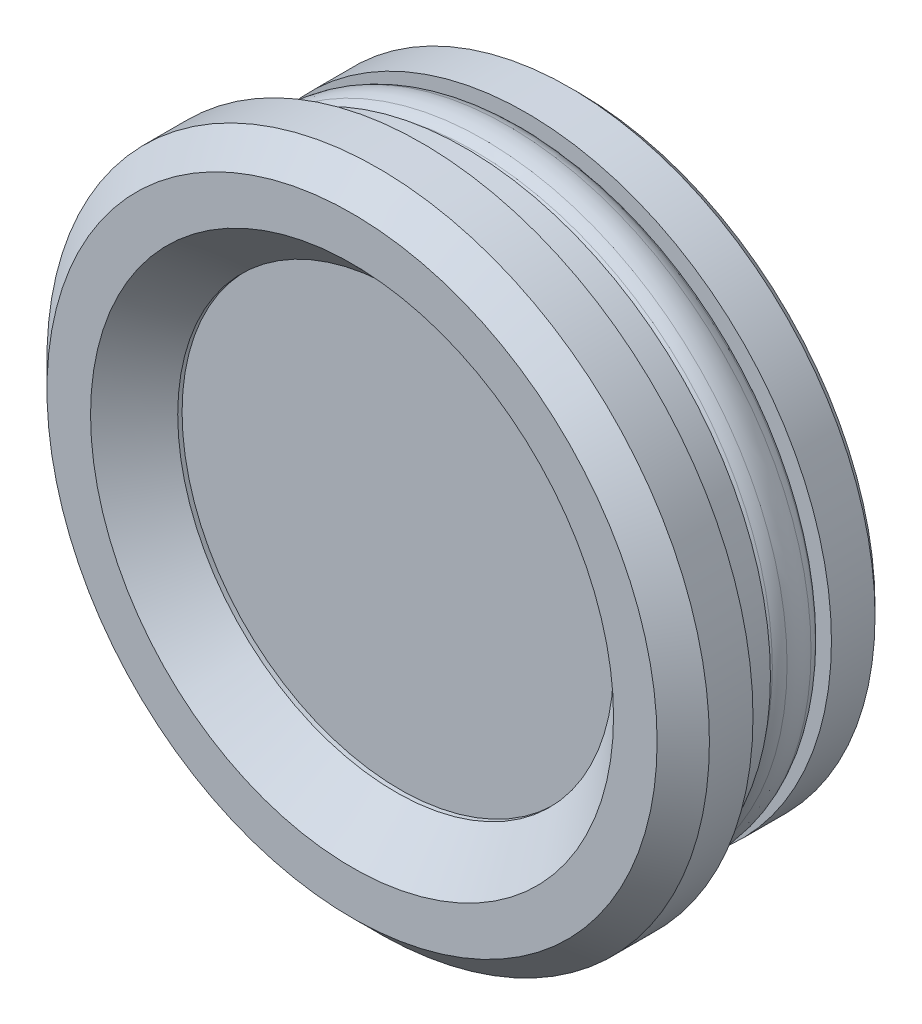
ISO-10303-21;
HEADER;
FILE_DESCRIPTION(('STEP AP214'),'2;1');
FILE_NAME('part.step','',(''),(''),'','','');
FILE_SCHEMA(('AUTOMOTIVE_DESIGN { 1 0 10303 214 1 1 1 1 }'));
ENDSEC;
DATA;
#1=APPLICATION_CONTEXT('core data for automotive mechanical design processes');
#2=APPLICATION_PROTOCOL_DEFINITION('international standard','automotive_design',2000,#1);
#3=PRODUCT_CONTEXT('',#1,'mechanical');
#4=PRODUCT('Part','Part','',(#3));
#5=PRODUCT_RELATED_PRODUCT_CATEGORY('part','',(#4));
#6=PRODUCT_DEFINITION_FORMATION('','',#4);
#7=PRODUCT_DEFINITION_CONTEXT('part definition',#1,'design');
#8=PRODUCT_DEFINITION('design','',#6,#7);
#9=PRODUCT_DEFINITION_SHAPE('','',#8);
#10=(LENGTH_UNIT() NAMED_UNIT(*) SI_UNIT(.MILLI.,.METRE.));
#11=(NAMED_UNIT(*) PLANE_ANGLE_UNIT() SI_UNIT($,.RADIAN.));
#12=(NAMED_UNIT(*) SI_UNIT($,.STERADIAN.) SOLID_ANGLE_UNIT());
#13=UNCERTAINTY_MEASURE_WITH_UNIT(LENGTH_MEASURE(1.E-05),#10,'distance_accuracy_value','');
#14=(GEOMETRIC_REPRESENTATION_CONTEXT(3) GLOBAL_UNCERTAINTY_ASSIGNED_CONTEXT((#13)) GLOBAL_UNIT_ASSIGNED_CONTEXT((#10,
#11,#12)) REPRESENTATION_CONTEXT('',''));
#15=CARTESIAN_POINT('',(0.,0.,0.));
#16=DIRECTION('',(0.,0.,1.));
#17=DIRECTION('',(1.,0.,0.));
#18=AXIS2_PLACEMENT_3D('',#15,#16,#17);
#19=CARTESIAN_POINT('',(0.,0.,-9.30000000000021));
#20=DIRECTION('',(0.,0.,-1.));
#21=DIRECTION('',(1.,0.,0.));
#22=AXIS2_PLACEMENT_3D('',#19,#20,#21);
#23=PLANE('',#22);
#24=CARTESIAN_POINT('',(0.,0.,-9.30000000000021));
#25=DIRECTION('',(0.,0.,-1.));
#26=DIRECTION('',(1.,0.,0.));
#27=AXIS2_PLACEMENT_3D('',#24,#25,#26);
#28=CIRCLE('',#27,16.0000000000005);
#29=CARTESIAN_POINT('',(16.0000000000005,0.,-9.30000000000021));
#30=VERTEX_POINT('',#29);
#31=EDGE_CURVE('E70',#30,#30,#28,.T.);
#32=ORIENTED_EDGE('',*,*,#31,.T.);
#33=EDGE_LOOP('',(#32));
#34=FACE_BOUND('',#33,.T.);
#35=ADVANCED_FACE('F12',(#34),#23,.T.);
#36=CARTESIAN_POINT('',(0.,0.,4.));
#37=DIRECTION('',(0.,0.,-1.));
#38=DIRECTION('',(1.,0.,0.));
#39=AXIS2_PLACEMENT_3D('',#36,#37,#38);
#40=PLANE('',#39);
#41=CARTESIAN_POINT('',(0.,0.,4.));
#42=DIRECTION('',(0.,0.,1.));
#43=DIRECTION('',(-1.,0.,0.));
#44=AXIS2_PLACEMENT_3D('',#41,#42,#43);
#45=CIRCLE('',#44,15.);
#46=CARTESIAN_POINT('',(-15.,0.,4.));
#47=VERTEX_POINT('',#46);
#48=EDGE_CURVE('E76',#47,#47,#45,.T.);
#49=ORIENTED_EDGE('',*,*,#48,.F.);
#50=EDGE_LOOP('',(#49));
#51=FACE_BOUND('',#50,.T.);
#52=CARTESIAN_POINT('',(0.,0.,4.));
#53=DIRECTION('',(0.,0.,-1.));
#54=DIRECTION('',(1.,0.,0.));
#55=AXIS2_PLACEMENT_3D('',#52,#53,#54);
#56=CIRCLE('',#55,17.4999999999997);
#57=CARTESIAN_POINT('',(17.4999999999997,0.,4.));
#58=VERTEX_POINT('',#57);
#59=EDGE_CURVE('E8',#58,#58,#56,.T.);
#60=ORIENTED_EDGE('',*,*,#59,.F.);
#61=EDGE_LOOP('',(#60));
#62=FACE_BOUND('',#61,.T.);
#63=ADVANCED_FACE('F92',(#51,#62),#40,.F.);
#64=CARTESIAN_POINT('',(0.,0.,4.));
#65=DIRECTION('',(0.,0.,-1.));
#66=DIRECTION('',(1.,0.,0.));
#67=AXIS2_PLACEMENT_3D('',#64,#65,#66);
#68=CONICAL_SURFACE('',#67,17.4999999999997,0.785398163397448);
#69=CARTESIAN_POINT('',(0.,0.,2.5));
#70=DIRECTION('',(0.,0.,-1.));
#71=DIRECTION('',(1.,0.,0.));
#72=AXIS2_PLACEMENT_3D('',#69,#70,#71);
#73=CIRCLE('',#72,18.9999999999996);
#74=CARTESIAN_POINT('',(18.9999999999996,0.,2.5));
#75=VERTEX_POINT('',#74);
#76=EDGE_CURVE('E18',#75,#75,#73,.T.);
#77=ORIENTED_EDGE('',*,*,#76,.F.);
#78=EDGE_LOOP('',(#77));
#79=FACE_BOUND('',#78,.T.);
#80=ORIENTED_EDGE('',*,*,#59,.T.);
#81=EDGE_LOOP('',(#80));
#82=FACE_BOUND('',#81,.T.);
#83=ADVANCED_FACE('F95',(#79,#82),#68,.T.);
#84=CARTESIAN_POINT('',(0.,0.,-15.9036843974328));
#85=DIRECTION('',(0.,0.,-1.));
#86=DIRECTION('',(1.,0.,0.));
#87=AXIS2_PLACEMENT_3D('',#84,#85,#86);
#88=CYLINDRICAL_SURFACE('',#87,18.9999999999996);
#89=CARTESIAN_POINT('',(0.,0.,0.));
#90=DIRECTION('',(0.,0.,-1.));
#91=DIRECTION('',(1.,0.,0.));
#92=AXIS2_PLACEMENT_3D('',#89,#90,#91);
#93=CIRCLE('',#92,18.9999999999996);
#94=CARTESIAN_POINT('',(18.9999999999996,0.,0.));
#95=VERTEX_POINT('',#94);
#96=EDGE_CURVE('E22',#95,#95,#93,.T.);
#97=ORIENTED_EDGE('',*,*,#96,.F.);
#98=EDGE_LOOP('',(#97));
#99=FACE_BOUND('',#98,.T.);
#100=ORIENTED_EDGE('',*,*,#76,.T.);
#101=EDGE_LOOP('',(#100));
#102=FACE_BOUND('',#101,.T.);
#103=ADVANCED_FACE('F102',(#99,#102),#88,.T.);
#104=CARTESIAN_POINT('',(0.,-17.5,0.));
#105=DIRECTION('',(0.,0.,-1.));
#106=DIRECTION('',(1.,0.,0.));
#107=AXIS2_PLACEMENT_3D('',#104,#105,#106);
#108=PLANE('',#107);
#109=ORIENTED_EDGE('',*,*,#96,.T.);
#110=EDGE_LOOP('',(#109));
#111=FACE_BOUND('',#110,.T.);
#112=CARTESIAN_POINT('',(0.,0.,0.));
#113=DIRECTION('',(0.,0.,-1.));
#114=DIRECTION('',(1.,0.,0.));
#115=AXIS2_PLACEMENT_3D('',#112,#113,#114);
#116=CIRCLE('',#115,17.5);
#117=CARTESIAN_POINT('',(17.5,0.,0.));
#118=VERTEX_POINT('',#117);
#119=EDGE_CURVE('E26',#118,#118,#116,.T.);
#120=ORIENTED_EDGE('',*,*,#119,.F.);
#121=EDGE_LOOP('',(#120));
#122=FACE_BOUND('',#121,.T.);
#123=ADVANCED_FACE('F109',(#111,#122),#108,.T.);
#124=CARTESIAN_POINT('',(0.,0.,-15.9036843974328));
#125=DIRECTION('',(0.,0.,-1.));
#126=DIRECTION('',(1.,0.,0.));
#127=AXIS2_PLACEMENT_3D('',#124,#125,#126);
#128=CYLINDRICAL_SURFACE('',#127,17.5);
#129=ORIENTED_EDGE('',*,*,#119,.T.);
#130=EDGE_LOOP('',(#129));
#131=FACE_BOUND('',#130,.T.);
#132=CARTESIAN_POINT('',(0.,0.,-2.5));
#133=DIRECTION('',(0.,0.,-1.));
#134=DIRECTION('',(1.,0.,0.));
#135=AXIS2_PLACEMENT_3D('',#132,#133,#134);
#136=CIRCLE('',#135,17.5);
#137=CARTESIAN_POINT('',(17.5,0.,-2.5));
#138=VERTEX_POINT('',#137);
#139=EDGE_CURVE('E31',#138,#138,#136,.T.);
#140=ORIENTED_EDGE('',*,*,#139,.F.);
#141=EDGE_LOOP('',(#140));
#142=FACE_BOUND('',#141,.T.);
#143=ADVANCED_FACE('F113',(#131,#142),#128,.T.);
#144=CARTESIAN_POINT('',(0.,-16.125,-2.5));
#145=DIRECTION('',(0.,0.,-1.));
#146=DIRECTION('',(1.,0.,0.));
#147=AXIS2_PLACEMENT_3D('',#144,#145,#146);
#148=PLANE('',#147);
#149=ORIENTED_EDGE('',*,*,#139,.T.);
#150=EDGE_LOOP('',(#149));
#151=FACE_BOUND('',#150,.T.);
#152=CARTESIAN_POINT('',(0.,0.,-2.5));
#153=DIRECTION('',(0.,0.,-1.));
#154=DIRECTION('',(1.,0.,0.));
#155=AXIS2_PLACEMENT_3D('',#152,#153,#154);
#156=CIRCLE('',#155,16.125);
#157=CARTESIAN_POINT('',(16.125,0.,-2.5));
#158=VERTEX_POINT('',#157);
#159=EDGE_CURVE('E34',#158,#158,#156,.T.);
#160=ORIENTED_EDGE('',*,*,#159,.F.);
#161=EDGE_LOOP('',(#160));
#162=FACE_BOUND('',#161,.T.);
#163=ADVANCED_FACE('F117',(#151,#162),#148,.T.);
#164=CARTESIAN_POINT('',(0.,0.,-3.59017590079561));
#165=DIRECTION('',(0.,0.,-1.));
#166=DIRECTION('',(1.,0.,0.));
#167=AXIS2_PLACEMENT_3D('',#164,#165,#166);
#168=TOROIDAL_SURFACE('',#167,16.125,1.09017590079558);
#169=CARTESIAN_POINT('',(0.,0.,-2.62580345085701));
#170=DIRECTION('',(0.,0.,-1.));
#171=DIRECTION('',(1.,0.,0.));
#172=AXIS2_PLACEMENT_3D('',#169,#170,#171);
#173=CIRCLE('',#172,16.6333987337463);
#174=CARTESIAN_POINT('',(16.6333987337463,0.,-2.62580345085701));
#175=VERTEX_POINT('',#174);
#176=EDGE_CURVE('E37',#175,#175,#173,.T.);
#177=ORIENTED_EDGE('',*,*,#176,.F.);
#178=EDGE_LOOP('',(#177));
#179=FACE_BOUND('',#178,.T.);
#180=ORIENTED_EDGE('',*,*,#159,.T.);
#181=EDGE_LOOP('',(#180));
#182=FACE_BOUND('',#181,.T.);
#183=ADVANCED_FACE('F121',(#179,#182),#168,.T.);
#184=CARTESIAN_POINT('',(0.,0.,-3.90823566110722));
#185=DIRECTION('',(0.,0.,-1.));
#186=DIRECTION('',(1.,0.,0.));
#187=AXIS2_PLACEMENT_3D('',#184,#185,#186);
#188=TOROIDAL_SURFACE('',#187,15.9573249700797,1.44972690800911);
#189=CARTESIAN_POINT('',(0.,0.,-3.01256313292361));
#190=DIRECTION('',(0.,0.,-1.));
#191=DIRECTION('',(1.,0.,0.));
#192=AXIS2_PLACEMENT_3D('',#189,#190,#191);
#193=CIRCLE('',#192,17.0972718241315);
#194=CARTESIAN_POINT('',(17.0972718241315,0.,-3.01256313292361));
#195=VERTEX_POINT('',#194);
#196=EDGE_CURVE('E40',#195,#195,#193,.T.);
#197=ORIENTED_EDGE('',*,*,#196,.F.);
#198=EDGE_LOOP('',(#197));
#199=FACE_BOUND('',#198,.T.);
#200=ORIENTED_EDGE('',*,*,#176,.T.);
#201=EDGE_LOOP('',(#200));
#202=FACE_BOUND('',#201,.T.);
#203=ADVANCED_FACE('F125',(#199,#202),#188,.T.);
#204=CARTESIAN_POINT('',(0.,0.,-4.11511038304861));
#205=DIRECTION('',(0.,0.,-1.));
#206=DIRECTION('',(1.,0.,0.));
#207=AXIS2_PLACEMENT_3D('',#204,#205,#206);
#208=TOROIDAL_SURFACE('',#207,15.6940298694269,1.78457233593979);
#209=CARTESIAN_POINT('',(0.,0.,-3.56282790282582));
#210=DIRECTION('',(0.,0.,-1.));
#211=DIRECTION('',(1.,0.,0.));
#212=AXIS2_PLACEMENT_3D('',#209,#210,#211);
#213=CIRCLE('',#212,17.3909925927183);
#214=CARTESIAN_POINT('',(17.3909925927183,0.,-3.56282790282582));
#215=VERTEX_POINT('',#214);
#216=EDGE_CURVE('E43',#215,#215,#213,.T.);
#217=ORIENTED_EDGE('',*,*,#216,.F.);
#218=EDGE_LOOP('',(#217));
#219=FACE_BOUND('',#218,.T.);
#220=ORIENTED_EDGE('',*,*,#196,.T.);
#221=EDGE_LOOP('',(#220));
#222=FACE_BOUND('',#221,.T.);
#223=ADVANCED_FACE('F129',(#219,#222),#208,.T.);
#224=CARTESIAN_POINT('',(0.,0.,-4.25));
#225=DIRECTION('',(0.,0.,-1.));
#226=DIRECTION('',(1.,0.,0.));
#227=AXIS2_PLACEMENT_3D('',#224,#225,#226);
#228=TOROIDAL_SURFACE('',#227,15.2795632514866,2.2204367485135);
#229=CARTESIAN_POINT('',(0.,0.,-4.93717209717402));
#230=DIRECTION('',(0.,0.,-1.));
#231=DIRECTION('',(1.,0.,0.));
#232=AXIS2_PLACEMENT_3D('',#229,#230,#231);
#233=CIRCLE('',#232,17.3909925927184);
#234=CARTESIAN_POINT('',(17.3909925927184,0.,-4.93717209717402));
#235=VERTEX_POINT('',#234);
#236=EDGE_CURVE('E46',#235,#235,#233,.T.);
#237=ORIENTED_EDGE('',*,*,#236,.F.);
#238=EDGE_LOOP('',(#237));
#239=FACE_BOUND('',#238,.T.);
#240=ORIENTED_EDGE('',*,*,#216,.T.);
#241=EDGE_LOOP('',(#240));
#242=FACE_BOUND('',#241,.T.);
#243=ADVANCED_FACE('F133',(#239,#242),#228,.T.);
#244=CARTESIAN_POINT('',(0.,0.,-4.3848896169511));
#245=DIRECTION('',(0.,0.,-1.));
#246=DIRECTION('',(1.,0.,0.));
#247=AXIS2_PLACEMENT_3D('',#244,#245,#246);
#248=TOROIDAL_SURFACE('',#247,15.6940298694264,1.78457233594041);
#249=CARTESIAN_POINT('',(0.,0.,-5.48743686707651));
#250=DIRECTION('',(0.,0.,-1.));
#251=DIRECTION('',(1.,0.,0.));
#252=AXIS2_PLACEMENT_3D('',#249,#250,#251);
#253=CIRCLE('',#252,17.0972718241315);
#254=CARTESIAN_POINT('',(17.0972718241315,0.,-5.48743686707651));
#255=VERTEX_POINT('',#254);
#256=EDGE_CURVE('E49',#255,#255,#253,.T.);
#257=ORIENTED_EDGE('',*,*,#256,.F.);
#258=EDGE_LOOP('',(#257));
#259=FACE_BOUND('',#258,.T.);
#260=ORIENTED_EDGE('',*,*,#236,.T.);
#261=EDGE_LOOP('',(#260));
#262=FACE_BOUND('',#261,.T.);
#263=ADVANCED_FACE('F137',(#259,#262),#248,.T.);
#264=CARTESIAN_POINT('',(0.,0.,-4.5917643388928));
#265=DIRECTION('',(0.,0.,-1.));
#266=DIRECTION('',(1.,0.,0.));
#267=AXIS2_PLACEMENT_3D('',#264,#265,#266);
#268=TOROIDAL_SURFACE('',#267,15.9573249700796,1.44972690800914);
#269=CARTESIAN_POINT('',(0.,0.,-5.87419654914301));
#270=DIRECTION('',(0.,0.,-1.));
#271=DIRECTION('',(1.,0.,0.));
#272=AXIS2_PLACEMENT_3D('',#269,#270,#271);
#273=CIRCLE('',#272,16.6333987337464);
#274=CARTESIAN_POINT('',(16.6333987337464,0.,-5.87419654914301));
#275=VERTEX_POINT('',#274);
#276=EDGE_CURVE('E52',#275,#275,#273,.T.);
#277=ORIENTED_EDGE('',*,*,#276,.F.);
#278=EDGE_LOOP('',(#277));
#279=FACE_BOUND('',#278,.T.);
#280=ORIENTED_EDGE('',*,*,#256,.T.);
#281=EDGE_LOOP('',(#280));
#282=FACE_BOUND('',#281,.T.);
#283=ADVANCED_FACE('F141',(#279,#282),#268,.T.);
#284=CARTESIAN_POINT('',(0.,0.,-4.9098240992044));
#285=DIRECTION('',(0.,0.,-1.));
#286=DIRECTION('',(1.,0.,0.));
#287=AXIS2_PLACEMENT_3D('',#284,#285,#286);
#288=TOROIDAL_SURFACE('',#287,16.125,1.09017590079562);
#289=CARTESIAN_POINT('',(0.,0.,-6.));
#290=DIRECTION('',(0.,0.,-1.));
#291=DIRECTION('',(1.,0.,0.));
#292=AXIS2_PLACEMENT_3D('',#289,#290,#291);
#293=CIRCLE('',#292,16.125);
#294=CARTESIAN_POINT('',(16.125,0.,-6.));
#295=VERTEX_POINT('',#294);
#296=EDGE_CURVE('E55',#295,#295,#293,.T.);
#297=ORIENTED_EDGE('',*,*,#296,.F.);
#298=EDGE_LOOP('',(#297));
#299=FACE_BOUND('',#298,.T.);
#300=ORIENTED_EDGE('',*,*,#276,.T.);
#301=EDGE_LOOP('',(#300));
#302=FACE_BOUND('',#301,.T.);
#303=ADVANCED_FACE('F145',(#299,#302),#288,.T.);
#304=CARTESIAN_POINT('',(0.,-16.125,-6.));
#305=DIRECTION('',(0.,0.,-1.));
#306=DIRECTION('',(1.,0.,0.));
#307=AXIS2_PLACEMENT_3D('',#304,#305,#306);
#308=PLANE('',#307);
#309=CARTESIAN_POINT('',(0.,0.,-6.));
#310=DIRECTION('',(0.,0.,-1.));
#311=DIRECTION('',(1.,0.,0.));
#312=AXIS2_PLACEMENT_3D('',#309,#310,#311);
#313=CIRCLE('',#312,17.5);
#314=CARTESIAN_POINT('',(17.5,0.,-6.));
#315=VERTEX_POINT('',#314);
#316=EDGE_CURVE('E58',#315,#315,#313,.T.);
#317=ORIENTED_EDGE('',*,*,#316,.F.);
#318=EDGE_LOOP('',(#317));
#319=FACE_BOUND('',#318,.T.);
#320=ORIENTED_EDGE('',*,*,#296,.T.);
#321=EDGE_LOOP('',(#320));
#322=FACE_BOUND('',#321,.T.);
#323=ADVANCED_FACE('F149',(#319,#322),#308,.F.);
#324=CARTESIAN_POINT('',(0.,0.,-15.9036843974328));
#325=DIRECTION('',(0.,0.,-1.));
#326=DIRECTION('',(1.,0.,0.));
#327=AXIS2_PLACEMENT_3D('',#324,#325,#326);
#328=CYLINDRICAL_SURFACE('',#327,17.5);
#329=ORIENTED_EDGE('',*,*,#316,.T.);
#330=EDGE_LOOP('',(#329));
#331=FACE_BOUND('',#330,.T.);
#332=CARTESIAN_POINT('',(0.,0.,-8.5));
#333=DIRECTION('',(0.,0.,-1.));
#334=DIRECTION('',(1.,0.,0.));
#335=AXIS2_PLACEMENT_3D('',#332,#333,#334);
#336=CIRCLE('',#335,17.5);
#337=CARTESIAN_POINT('',(17.5,0.,-8.5));
#338=VERTEX_POINT('',#337);
#339=EDGE_CURVE('E61',#338,#338,#336,.T.);
#340=ORIENTED_EDGE('',*,*,#339,.F.);
#341=EDGE_LOOP('',(#340));
#342=FACE_BOUND('',#341,.T.);
#343=ADVANCED_FACE('F153',(#331,#342),#328,.T.);
#344=CARTESIAN_POINT('',(0.,0.,-9.));
#345=DIRECTION('',(0.,0.,1.));
#346=DIRECTION('',(-1.,0.,0.));
#347=AXIS2_PLACEMENT_3D('',#344,#345,#346);
#348=CONICAL_SURFACE('',#347,17.,0.785398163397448);
#349=ORIENTED_EDGE('',*,*,#339,.T.);
#350=EDGE_LOOP('',(#349));
#351=FACE_BOUND('',#350,.T.);
#352=CARTESIAN_POINT('',(0.,0.,-9.));
#353=DIRECTION('',(0.,0.,-1.));
#354=DIRECTION('',(1.,0.,0.));
#355=AXIS2_PLACEMENT_3D('',#352,#353,#354);
#356=CIRCLE('',#355,17.);
#357=CARTESIAN_POINT('',(17.,0.,-9.));
#358=VERTEX_POINT('',#357);
#359=EDGE_CURVE('E64',#358,#358,#356,.T.);
#360=ORIENTED_EDGE('',*,*,#359,.F.);
#361=EDGE_LOOP('',(#360));
#362=FACE_BOUND('',#361,.T.);
#363=ADVANCED_FACE('F157',(#351,#362),#348,.T.);
#364=CARTESIAN_POINT('',(0.,-16.0000000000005,-9.));
#365=DIRECTION('',(0.,0.,-1.));
#366=DIRECTION('',(1.,0.,0.));
#367=AXIS2_PLACEMENT_3D('',#364,#365,#366);
#368=PLANE('',#367);
#369=ORIENTED_EDGE('',*,*,#359,.T.);
#370=EDGE_LOOP('',(#369));
#371=FACE_BOUND('',#370,.T.);
#372=CARTESIAN_POINT('',(0.,0.,-9.));
#373=DIRECTION('',(0.,0.,-1.));
#374=DIRECTION('',(1.,0.,0.));
#375=AXIS2_PLACEMENT_3D('',#372,#373,#374);
#376=CIRCLE('',#375,16.0000000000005);
#377=CARTESIAN_POINT('',(16.0000000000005,0.,-9.));
#378=VERTEX_POINT('',#377);
#379=EDGE_CURVE('E67',#378,#378,#376,.T.);
#380=ORIENTED_EDGE('',*,*,#379,.F.);
#381=EDGE_LOOP('',(#380));
#382=FACE_BOUND('',#381,.T.);
#383=ADVANCED_FACE('F161',(#371,#382),#368,.T.);
#384=CARTESIAN_POINT('',(0.,0.,-15.9036843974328));
#385=DIRECTION('',(0.,0.,-1.));
#386=DIRECTION('',(1.,0.,0.));
#387=AXIS2_PLACEMENT_3D('',#384,#385,#386);
#388=CYLINDRICAL_SURFACE('',#387,16.0000000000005);
#389=ORIENTED_EDGE('',*,*,#379,.T.);
#390=EDGE_LOOP('',(#389));
#391=FACE_BOUND('',#390,.T.);
#392=ORIENTED_EDGE('',*,*,#31,.F.);
#393=EDGE_LOOP('',(#392));
#394=FACE_BOUND('',#393,.T.);
#395=ADVANCED_FACE('F165',(#391,#394),#388,.T.);
#396=CARTESIAN_POINT('',(0.,0.,6.22113275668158));
#397=DIRECTION('',(0.,0.,1.));
#398=DIRECTION('',(-1.,0.,0.));
#399=AXIS2_PLACEMENT_3D('',#396,#397,#398);
#400=CYLINDRICAL_SURFACE('',#399,12.5);
#401=CARTESIAN_POINT('',(0.,0.,1.24999999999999));
#402=DIRECTION('',(0.,0.,1.));
#403=DIRECTION('',(-1.,0.,0.));
#404=AXIS2_PLACEMENT_3D('',#401,#402,#403);
#405=CIRCLE('',#404,12.5);
#406=CARTESIAN_POINT('',(-12.5,0.,1.24999999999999));
#407=VERTEX_POINT('',#406);
#408=EDGE_CURVE('E73',#407,#407,#405,.T.);
#409=ORIENTED_EDGE('',*,*,#408,.F.);
#410=EDGE_LOOP('',(#409));
#411=FACE_BOUND('',#410,.T.);
#412=CARTESIAN_POINT('',(0.,0.,1.49999999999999));
#413=DIRECTION('',(0.,0.,1.));
#414=DIRECTION('',(-1.,0.,0.));
#415=AXIS2_PLACEMENT_3D('',#412,#413,#414);
#416=CIRCLE('',#415,12.5);
#417=CARTESIAN_POINT('',(-12.5,0.,1.49999999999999));
#418=VERTEX_POINT('',#417);
#419=EDGE_CURVE('E79',#418,#418,#416,.T.);
#420=ORIENTED_EDGE('',*,*,#419,.T.);
#421=EDGE_LOOP('',(#420));
#422=FACE_BOUND('',#421,.T.);
#423=ADVANCED_FACE('F83',(#411,#422),#400,.F.);
#424=CARTESIAN_POINT('',(0.,-12.5,1.24999999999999));
#425=DIRECTION('',(0.,0.,-1.));
#426=DIRECTION('',(1.,0.,0.));
#427=AXIS2_PLACEMENT_3D('',#424,#425,#426);
#428=PLANE('',#427);
#429=ORIENTED_EDGE('',*,*,#408,.T.);
#430=EDGE_LOOP('',(#429));
#431=FACE_BOUND('',#430,.T.);
#432=ADVANCED_FACE('F88',(#431),#428,.F.);
#433=CARTESIAN_POINT('',(0.,0.,4.));
#434=DIRECTION('',(0.,0.,1.));
#435=DIRECTION('',(-1.,0.,0.));
#436=AXIS2_PLACEMENT_3D('',#433,#434,#435);
#437=CONICAL_SURFACE('',#436,15.,0.785398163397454);
#438=ORIENTED_EDGE('',*,*,#419,.F.);
#439=EDGE_LOOP('',(#438));
#440=FACE_BOUND('',#439,.T.);
#441=ORIENTED_EDGE('',*,*,#48,.T.);
#442=EDGE_LOOP('',(#441));
#443=FACE_BOUND('',#442,.T.);
#444=ADVANCED_FACE('F85',(#440,#443),#437,.F.);
#445=CLOSED_SHELL('',(#35,#63,#83,#103,#123,#143,#163,#183,#203,#223,#243,#263,#283,#303,#323,
#343,#363,#383,#395,#423,#432,#444));
#446=MANIFOLD_SOLID_BREP('B1',#445);
#447=ADVANCED_BREP_SHAPE_REPRESENTATION('',(#18,#446),#14);
#448=SHAPE_DEFINITION_REPRESENTATION(#9,#447);
ENDSEC;
END-ISO-10303-21;
